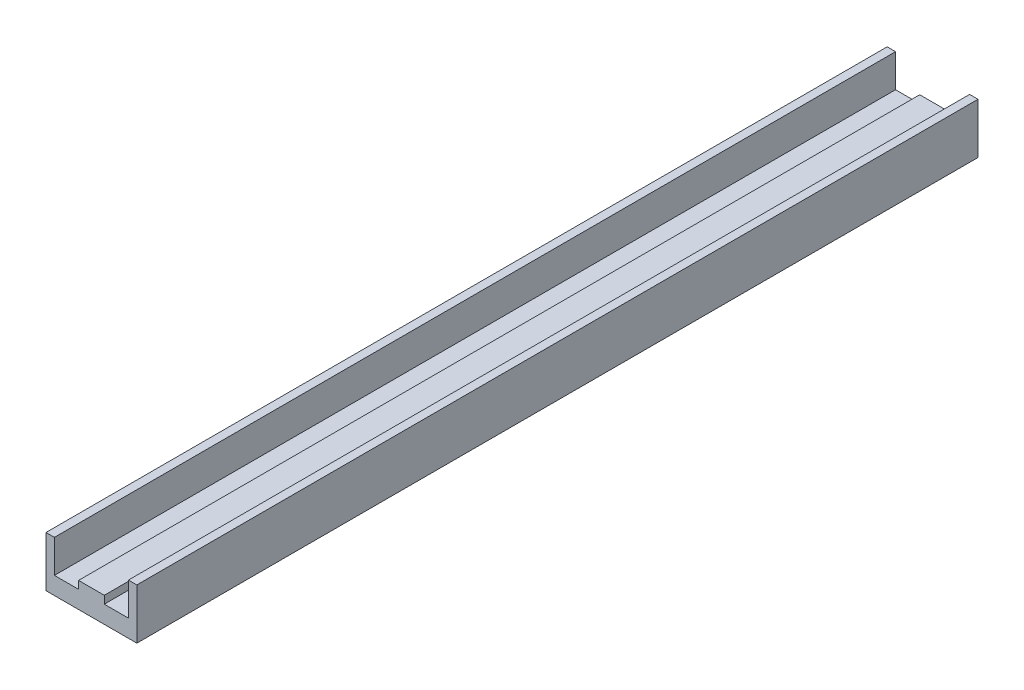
ISO-10303-21;
HEADER;
FILE_DESCRIPTION(('STEP AP214'),'2;1');
FILE_NAME('part.step','',(''),(''),'','','');
FILE_SCHEMA(('AUTOMOTIVE_DESIGN { 1 0 10303 214 1 1 1 1 }'));
ENDSEC;
DATA;
#1=APPLICATION_CONTEXT('core data for automotive mechanical design processes');
#2=APPLICATION_PROTOCOL_DEFINITION('international standard','automotive_design',2000,#1);
#3=PRODUCT_CONTEXT('',#1,'mechanical');
#4=PRODUCT('Part','Part','',(#3));
#5=PRODUCT_RELATED_PRODUCT_CATEGORY('part','',(#4));
#6=PRODUCT_DEFINITION_FORMATION('','',#4);
#7=PRODUCT_DEFINITION_CONTEXT('part definition',#1,'design');
#8=PRODUCT_DEFINITION('design','',#6,#7);
#9=PRODUCT_DEFINITION_SHAPE('','',#8);
#10=(LENGTH_UNIT() NAMED_UNIT(*) SI_UNIT(.MILLI.,.METRE.));
#11=(NAMED_UNIT(*) PLANE_ANGLE_UNIT() SI_UNIT($,.RADIAN.));
#12=(NAMED_UNIT(*) SI_UNIT($,.STERADIAN.) SOLID_ANGLE_UNIT());
#13=UNCERTAINTY_MEASURE_WITH_UNIT(LENGTH_MEASURE(1.E-05),#10,'distance_accuracy_value','');
#14=(GEOMETRIC_REPRESENTATION_CONTEXT(3) GLOBAL_UNCERTAINTY_ASSIGNED_CONTEXT((#13)) GLOBAL_UNIT_ASSIGNED_CONTEXT((#10,
#11,#12)) REPRESENTATION_CONTEXT('',''));
#15=CARTESIAN_POINT('',(0.,0.,0.));
#16=DIRECTION('',(0.,0.,1.));
#17=DIRECTION('',(1.,0.,0.));
#18=AXIS2_PLACEMENT_3D('',#15,#16,#17);
#19=CARTESIAN_POINT('',(-27.,30.,500.));
#20=DIRECTION('',(1.,0.,0.));
#21=DIRECTION('',(0.,0.,-1.));
#22=AXIS2_PLACEMENT_3D('',#19,#20,#21);
#23=PLANE('',#22);
#24=DIRECTION('',(0.,-1.,0.));
#25=VECTOR('',#24,1.);
#26=CARTESIAN_POINT('',(-27.,30.,0.));
#27=LINE('',#26,#25);
#28=CARTESIAN_POINT('',(-27.,30.,0.));
#29=VERTEX_POINT('',#28);
#30=CARTESIAN_POINT('',(-27.,0.,0.));
#31=VERTEX_POINT('',#30);
#32=EDGE_CURVE('E134',#29,#31,#27,.T.);
#33=ORIENTED_EDGE('',*,*,#32,.T.);
#34=DIRECTION('',(0.,0.,-1.));
#35=VECTOR('',#34,1.);
#36=CARTESIAN_POINT('',(-27.,0.,500.));
#37=LINE('',#36,#35);
#38=CARTESIAN_POINT('',(-27.,0.,500.));
#39=VERTEX_POINT('',#38);
#40=EDGE_CURVE('E9',#39,#31,#37,.T.);
#41=ORIENTED_EDGE('',*,*,#40,.F.);
#42=DIRECTION('',(0.,-1.,0.));
#43=VECTOR('',#42,1.);
#44=CARTESIAN_POINT('',(-27.,30.,500.));
#45=LINE('',#44,#43);
#46=CARTESIAN_POINT('',(-27.,30.,500.));
#47=VERTEX_POINT('',#46);
#48=EDGE_CURVE('E156',#47,#39,#45,.T.);
#49=ORIENTED_EDGE('',*,*,#48,.F.);
#50=DIRECTION('',(0.,0.,-1.));
#51=VECTOR('',#50,1.);
#52=CARTESIAN_POINT('',(-27.,30.,500.));
#53=LINE('',#52,#51);
#54=EDGE_CURVE('E130',#47,#29,#53,.T.);
#55=ORIENTED_EDGE('',*,*,#54,.T.);
#56=EDGE_LOOP('',(#33,#41,#49,#55));
#57=FACE_BOUND('',#56,.T.);
#58=ADVANCED_FACE('F14',(#57),#23,.F.);
#59=CARTESIAN_POINT('',(-27.,0.,500.));
#60=DIRECTION('',(0.,1.,0.));
#61=DIRECTION('',(0.,0.,1.));
#62=AXIS2_PLACEMENT_3D('',#59,#60,#61);
#63=PLANE('',#62);
#64=DIRECTION('',(1.,0.,0.));
#65=VECTOR('',#64,1.);
#66=CARTESIAN_POINT('',(-27.,0.,0.));
#67=LINE('',#66,#65);
#68=CARTESIAN_POINT('',(27.,0.,0.));
#69=VERTEX_POINT('',#68);
#70=EDGE_CURVE('E137',#31,#69,#67,.T.);
#71=ORIENTED_EDGE('',*,*,#70,.T.);
#72=DIRECTION('',(0.,0.,-1.));
#73=VECTOR('',#72,1.);
#74=CARTESIAN_POINT('',(27.,0.,500.));
#75=LINE('',#74,#73);
#76=CARTESIAN_POINT('',(27.,0.,500.));
#77=VERTEX_POINT('',#76);
#78=EDGE_CURVE('E22',#77,#69,#75,.T.);
#79=ORIENTED_EDGE('',*,*,#78,.F.);
#80=DIRECTION('',(1.,0.,0.));
#81=VECTOR('',#80,1.);
#82=CARTESIAN_POINT('',(-27.,0.,500.));
#83=LINE('',#82,#81);
#84=EDGE_CURVE('E85',#39,#77,#83,.T.);
#85=ORIENTED_EDGE('',*,*,#84,.F.);
#86=ORIENTED_EDGE('',*,*,#40,.T.);
#87=EDGE_LOOP('',(#71,#79,#85,#86));
#88=FACE_BOUND('',#87,.T.);
#89=ADVANCED_FACE('F236',(#88),#63,.F.);
#90=CARTESIAN_POINT('',(27.,30.,500.));
#91=DIRECTION('',(-1.,0.,0.));
#92=DIRECTION('',(0.,0.,1.));
#93=AXIS2_PLACEMENT_3D('',#90,#91,#92);
#94=PLANE('',#93);
#95=DIRECTION('',(0.,1.,0.));
#96=VECTOR('',#95,1.);
#97=CARTESIAN_POINT('',(27.,30.,0.));
#98=LINE('',#97,#96);
#99=CARTESIAN_POINT('',(27.,30.,0.));
#100=VERTEX_POINT('',#99);
#101=EDGE_CURVE('E139',#69,#100,#98,.T.);
#102=ORIENTED_EDGE('',*,*,#101,.T.);
#103=DIRECTION('',(0.,0.,-1.));
#104=VECTOR('',#103,1.);
#105=CARTESIAN_POINT('',(27.,30.,500.));
#106=LINE('',#105,#104);
#107=CARTESIAN_POINT('',(27.,30.,500.));
#108=VERTEX_POINT('',#107);
#109=EDGE_CURVE('E175',#108,#100,#106,.T.);
#110=ORIENTED_EDGE('',*,*,#109,.F.);
#111=DIRECTION('',(0.,1.,0.));
#112=VECTOR('',#111,1.);
#113=CARTESIAN_POINT('',(27.,30.,500.));
#114=LINE('',#113,#112);
#115=EDGE_CURVE('E183',#77,#108,#114,.T.);
#116=ORIENTED_EDGE('',*,*,#115,.F.);
#117=ORIENTED_EDGE('',*,*,#78,.T.);
#118=EDGE_LOOP('',(#102,#110,#116,#117));
#119=FACE_BOUND('',#118,.T.);
#120=ADVANCED_FACE('F181',(#119),#94,.F.);
#121=CARTESIAN_POINT('',(22.,30.,500.));
#122=DIRECTION('',(0.,-1.,0.));
#123=DIRECTION('',(0.,0.,-1.));
#124=AXIS2_PLACEMENT_3D('',#121,#122,#123);
#125=PLANE('',#124);
#126=DIRECTION('',(-1.,0.,0.));
#127=VECTOR('',#126,1.);
#128=CARTESIAN_POINT('',(22.,30.,0.));
#129=LINE('',#128,#127);
#130=CARTESIAN_POINT('',(22.,30.,0.));
#131=VERTEX_POINT('',#130);
#132=EDGE_CURVE('E141',#100,#131,#129,.T.);
#133=ORIENTED_EDGE('',*,*,#132,.T.);
#134=DIRECTION('',(0.,0.,-1.));
#135=VECTOR('',#134,1.);
#136=CARTESIAN_POINT('',(22.,30.,500.));
#137=LINE('',#136,#135);
#138=CARTESIAN_POINT('',(22.,30.,500.));
#139=VERTEX_POINT('',#138);
#140=EDGE_CURVE('E172',#139,#131,#137,.T.);
#141=ORIENTED_EDGE('',*,*,#140,.F.);
#142=DIRECTION('',(-1.,0.,0.));
#143=VECTOR('',#142,1.);
#144=CARTESIAN_POINT('',(22.,30.,500.));
#145=LINE('',#144,#143);
#146=EDGE_CURVE('E201',#108,#139,#145,.T.);
#147=ORIENTED_EDGE('',*,*,#146,.F.);
#148=ORIENTED_EDGE('',*,*,#109,.T.);
#149=EDGE_LOOP('',(#133,#141,#147,#148));
#150=FACE_BOUND('',#149,.T.);
#151=ADVANCED_FACE('F192',(#150),#125,.F.);
#152=CARTESIAN_POINT('',(22.,30.,500.));
#153=DIRECTION('',(1.,0.,0.));
#154=DIRECTION('',(0.,0.,-1.));
#155=AXIS2_PLACEMENT_3D('',#152,#153,#154);
#156=PLANE('',#155);
#157=DIRECTION('',(0.,-1.,0.));
#158=VECTOR('',#157,1.);
#159=CARTESIAN_POINT('',(22.,30.,0.));
#160=LINE('',#159,#158);
#161=CARTESIAN_POINT('',(22.,10.3999999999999,0.));
#162=VERTEX_POINT('',#161);
#163=EDGE_CURVE('E143',#131,#162,#160,.T.);
#164=ORIENTED_EDGE('',*,*,#163,.T.);
#165=DIRECTION('',(0.,0.,-1.));
#166=VECTOR('',#165,1.);
#167=CARTESIAN_POINT('',(22.,10.3999999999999,500.));
#168=LINE('',#167,#166);
#169=CARTESIAN_POINT('',(22.,10.3999999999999,500.));
#170=VERTEX_POINT('',#169);
#171=EDGE_CURVE('E169',#170,#162,#168,.T.);
#172=ORIENTED_EDGE('',*,*,#171,.F.);
#173=DIRECTION('',(0.,-1.,0.));
#174=VECTOR('',#173,1.);
#175=CARTESIAN_POINT('',(22.,30.,500.));
#176=LINE('',#175,#174);
#177=EDGE_CURVE('E198',#139,#170,#176,.T.);
#178=ORIENTED_EDGE('',*,*,#177,.F.);
#179=ORIENTED_EDGE('',*,*,#140,.T.);
#180=EDGE_LOOP('',(#164,#172,#178,#179));
#181=FACE_BOUND('',#180,.T.);
#182=ADVANCED_FACE('F196',(#181),#156,.F.);
#183=CARTESIAN_POINT('',(7.65,10.3999999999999,500.));
#184=DIRECTION('',(0.,-1.,0.));
#185=DIRECTION('',(0.,0.,-1.));
#186=AXIS2_PLACEMENT_3D('',#183,#184,#185);
#187=PLANE('',#186);
#188=DIRECTION('',(-1.,0.,0.));
#189=VECTOR('',#188,1.);
#190=CARTESIAN_POINT('',(7.65,10.3999999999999,0.));
#191=LINE('',#190,#189);
#192=CARTESIAN_POINT('',(7.65,10.3999999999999,0.));
#193=VERTEX_POINT('',#192);
#194=EDGE_CURVE('E145',#162,#193,#191,.T.);
#195=ORIENTED_EDGE('',*,*,#194,.T.);
#196=DIRECTION('',(0.,0.,-1.));
#197=VECTOR('',#196,1.);
#198=CARTESIAN_POINT('',(7.65,10.3999999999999,500.));
#199=LINE('',#198,#197);
#200=CARTESIAN_POINT('',(7.65,10.3999999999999,500.));
#201=VERTEX_POINT('',#200);
#202=EDGE_CURVE('E166',#201,#193,#199,.T.);
#203=ORIENTED_EDGE('',*,*,#202,.F.);
#204=DIRECTION('',(-1.,0.,0.));
#205=VECTOR('',#204,1.);
#206=CARTESIAN_POINT('',(7.65,10.3999999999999,500.));
#207=LINE('',#206,#205);
#208=EDGE_CURVE('E200',#170,#201,#207,.T.);
#209=ORIENTED_EDGE('',*,*,#208,.F.);
#210=ORIENTED_EDGE('',*,*,#171,.T.);
#211=EDGE_LOOP('',(#195,#203,#209,#210));
#212=FACE_BOUND('',#211,.T.);
#213=ADVANCED_FACE('F251',(#212),#187,.F.);
#214=CARTESIAN_POINT('',(7.65,15.,500.));
#215=DIRECTION('',(-1.,0.,0.));
#216=DIRECTION('',(0.,0.,1.));
#217=AXIS2_PLACEMENT_3D('',#214,#215,#216);
#218=PLANE('',#217);
#219=DIRECTION('',(0.,1.,0.));
#220=VECTOR('',#219,1.);
#221=CARTESIAN_POINT('',(7.65,15.,0.));
#222=LINE('',#221,#220);
#223=CARTESIAN_POINT('',(7.65,15.,0.));
#224=VERTEX_POINT('',#223);
#225=EDGE_CURVE('E147',#193,#224,#222,.T.);
#226=ORIENTED_EDGE('',*,*,#225,.T.);
#227=DIRECTION('',(0.,0.,-1.));
#228=VECTOR('',#227,1.);
#229=CARTESIAN_POINT('',(7.65,15.,500.));
#230=LINE('',#229,#228);
#231=CARTESIAN_POINT('',(7.65,15.,500.));
#232=VERTEX_POINT('',#231);
#233=EDGE_CURVE('E163',#232,#224,#230,.T.);
#234=ORIENTED_EDGE('',*,*,#233,.F.);
#235=DIRECTION('',(0.,1.,0.));
#236=VECTOR('',#235,1.);
#237=CARTESIAN_POINT('',(7.65,15.,500.));
#238=LINE('',#237,#236);
#239=EDGE_CURVE('E203',#201,#232,#238,.T.);
#240=ORIENTED_EDGE('',*,*,#239,.F.);
#241=ORIENTED_EDGE('',*,*,#202,.T.);
#242=EDGE_LOOP('',(#226,#234,#240,#241));
#243=FACE_BOUND('',#242,.T.);
#244=ADVANCED_FACE('F254',(#243),#218,.F.);
#245=CARTESIAN_POINT('',(-7.65,15.,500.));
#246=DIRECTION('',(0.,-1.,0.));
#247=DIRECTION('',(0.,0.,-1.));
#248=AXIS2_PLACEMENT_3D('',#245,#246,#247);
#249=PLANE('',#248);
#250=DIRECTION('',(-1.,0.,0.));
#251=VECTOR('',#250,1.);
#252=CARTESIAN_POINT('',(-7.65,15.,0.));
#253=LINE('',#252,#251);
#254=CARTESIAN_POINT('',(-7.65,15.,0.));
#255=VERTEX_POINT('',#254);
#256=EDGE_CURVE('E149',#224,#255,#253,.T.);
#257=ORIENTED_EDGE('',*,*,#256,.T.);
#258=DIRECTION('',(0.,0.,-1.));
#259=VECTOR('',#258,1.);
#260=CARTESIAN_POINT('',(-7.65,15.,500.));
#261=LINE('',#260,#259);
#262=CARTESIAN_POINT('',(-7.65,15.,500.));
#263=VERTEX_POINT('',#262);
#264=EDGE_CURVE('E160',#263,#255,#261,.T.);
#265=ORIENTED_EDGE('',*,*,#264,.F.);
#266=DIRECTION('',(-1.,0.,0.));
#267=VECTOR('',#266,1.);
#268=CARTESIAN_POINT('',(-7.65,15.,500.));
#269=LINE('',#268,#267);
#270=EDGE_CURVE('E209',#232,#263,#269,.T.);
#271=ORIENTED_EDGE('',*,*,#270,.F.);
#272=ORIENTED_EDGE('',*,*,#233,.T.);
#273=EDGE_LOOP('',(#257,#265,#271,#272));
#274=FACE_BOUND('',#273,.T.);
#275=ADVANCED_FACE('F215',(#274),#249,.F.);
#276=CARTESIAN_POINT('',(-7.65,15.,500.));
#277=DIRECTION('',(1.,0.,0.));
#278=DIRECTION('',(0.,0.,-1.));
#279=AXIS2_PLACEMENT_3D('',#276,#277,#278);
#280=PLANE('',#279);
#281=DIRECTION('',(0.,-1.,0.));
#282=VECTOR('',#281,1.);
#283=CARTESIAN_POINT('',(-7.65,15.,0.));
#284=LINE('',#283,#282);
#285=CARTESIAN_POINT('',(-7.65,10.3999999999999,0.));
#286=VERTEX_POINT('',#285);
#287=EDGE_CURVE('E151',#255,#286,#284,.T.);
#288=ORIENTED_EDGE('',*,*,#287,.T.);
#289=DIRECTION('',(0.,0.,-1.));
#290=VECTOR('',#289,1.);
#291=CARTESIAN_POINT('',(-7.65,10.3999999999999,500.));
#292=LINE('',#291,#290);
#293=CARTESIAN_POINT('',(-7.65,10.3999999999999,500.));
#294=VERTEX_POINT('',#293);
#295=EDGE_CURVE('E125',#294,#286,#292,.T.);
#296=ORIENTED_EDGE('',*,*,#295,.F.);
#297=DIRECTION('',(0.,-1.,0.));
#298=VECTOR('',#297,1.);
#299=CARTESIAN_POINT('',(-7.65,15.,500.));
#300=LINE('',#299,#298);
#301=EDGE_CURVE('E116',#263,#294,#300,.T.);
#302=ORIENTED_EDGE('',*,*,#301,.F.);
#303=ORIENTED_EDGE('',*,*,#264,.T.);
#304=EDGE_LOOP('',(#288,#296,#302,#303));
#305=FACE_BOUND('',#304,.T.);
#306=ADVANCED_FACE('F219',(#305),#280,.F.);
#307=CARTESIAN_POINT('',(-22.,10.3999999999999,500.));
#308=DIRECTION('',(0.,-1.,0.));
#309=DIRECTION('',(0.,0.,-1.));
#310=AXIS2_PLACEMENT_3D('',#307,#308,#309);
#311=PLANE('',#310);
#312=DIRECTION('',(-1.,0.,0.));
#313=VECTOR('',#312,1.);
#314=CARTESIAN_POINT('',(-22.,10.3999999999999,0.));
#315=LINE('',#314,#313);
#316=CARTESIAN_POINT('',(-22.,10.3999999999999,0.));
#317=VERTEX_POINT('',#316);
#318=EDGE_CURVE('E124',#286,#317,#315,.T.);
#319=ORIENTED_EDGE('',*,*,#318,.T.);
#320=DIRECTION('',(0.,0.,-1.));
#321=VECTOR('',#320,1.);
#322=CARTESIAN_POINT('',(-22.,10.3999999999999,500.));
#323=LINE('',#322,#321);
#324=CARTESIAN_POINT('',(-22.,10.3999999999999,500.));
#325=VERTEX_POINT('',#324);
#326=EDGE_CURVE('E121',#325,#317,#323,.T.);
#327=ORIENTED_EDGE('',*,*,#326,.F.);
#328=DIRECTION('',(-1.,0.,0.));
#329=VECTOR('',#328,1.);
#330=CARTESIAN_POINT('',(-22.,10.3999999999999,500.));
#331=LINE('',#330,#329);
#332=EDGE_CURVE('E110',#294,#325,#331,.T.);
#333=ORIENTED_EDGE('',*,*,#332,.F.);
#334=ORIENTED_EDGE('',*,*,#295,.T.);
#335=EDGE_LOOP('',(#319,#327,#333,#334));
#336=FACE_BOUND('',#335,.T.);
#337=ADVANCED_FACE('F122',(#336),#311,.F.);
#338=CARTESIAN_POINT('',(-22.,30.,500.));
#339=DIRECTION('',(-1.,0.,0.));
#340=DIRECTION('',(0.,0.,1.));
#341=AXIS2_PLACEMENT_3D('',#338,#339,#340);
#342=PLANE('',#341);
#343=DIRECTION('',(0.,1.,0.));
#344=VECTOR('',#343,1.);
#345=CARTESIAN_POINT('',(-22.,30.,0.));
#346=LINE('',#345,#344);
#347=CARTESIAN_POINT('',(-22.,30.,0.));
#348=VERTEX_POINT('',#347);
#349=EDGE_CURVE('E71',#317,#348,#346,.T.);
#350=ORIENTED_EDGE('',*,*,#349,.T.);
#351=DIRECTION('',(0.,0.,-1.));
#352=VECTOR('',#351,1.);
#353=CARTESIAN_POINT('',(-22.,30.,500.));
#354=LINE('',#353,#352);
#355=CARTESIAN_POINT('',(-22.,30.,500.));
#356=VERTEX_POINT('',#355);
#357=EDGE_CURVE('E126',#356,#348,#354,.T.);
#358=ORIENTED_EDGE('',*,*,#357,.F.);
#359=DIRECTION('',(0.,1.,0.));
#360=VECTOR('',#359,1.);
#361=CARTESIAN_POINT('',(-22.,30.,500.));
#362=LINE('',#361,#360);
#363=EDGE_CURVE('E114',#325,#356,#362,.T.);
#364=ORIENTED_EDGE('',*,*,#363,.F.);
#365=ORIENTED_EDGE('',*,*,#326,.T.);
#366=EDGE_LOOP('',(#350,#358,#364,#365));
#367=FACE_BOUND('',#366,.T.);
#368=ADVANCED_FACE('F128',(#367),#342,.F.);
#369=CARTESIAN_POINT('',(-27.,30.,500.));
#370=DIRECTION('',(0.,-1.,0.));
#371=DIRECTION('',(0.,0.,-1.));
#372=AXIS2_PLACEMENT_3D('',#369,#370,#371);
#373=PLANE('',#372);
#374=DIRECTION('',(-1.,0.,0.));
#375=VECTOR('',#374,1.);
#376=CARTESIAN_POINT('',(-27.,30.,0.));
#377=LINE('',#376,#375);
#378=EDGE_CURVE('E77',#348,#29,#377,.T.);
#379=ORIENTED_EDGE('',*,*,#378,.T.);
#380=ORIENTED_EDGE('',*,*,#54,.F.);
#381=DIRECTION('',(-1.,0.,0.));
#382=VECTOR('',#381,1.);
#383=CARTESIAN_POINT('',(-27.,30.,500.));
#384=LINE('',#383,#382);
#385=EDGE_CURVE('E30',#356,#47,#384,.T.);
#386=ORIENTED_EDGE('',*,*,#385,.F.);
#387=ORIENTED_EDGE('',*,*,#357,.T.);
#388=EDGE_LOOP('',(#379,#380,#386,#387));
#389=FACE_BOUND('',#388,.T.);
#390=ADVANCED_FACE('F223',(#389),#373,.F.);
#391=CARTESIAN_POINT('',(-27.,0.,500.));
#392=DIRECTION('',(0.,0.,1.));
#393=DIRECTION('',(1.,0.,0.));
#394=AXIS2_PLACEMENT_3D('',#391,#392,#393);
#395=PLANE('',#394);
#396=ORIENTED_EDGE('',*,*,#48,.T.);
#397=ORIENTED_EDGE('',*,*,#84,.T.);
#398=ORIENTED_EDGE('',*,*,#115,.T.);
#399=ORIENTED_EDGE('',*,*,#146,.T.);
#400=ORIENTED_EDGE('',*,*,#177,.T.);
#401=ORIENTED_EDGE('',*,*,#208,.T.);
#402=ORIENTED_EDGE('',*,*,#239,.T.);
#403=ORIENTED_EDGE('',*,*,#270,.T.);
#404=ORIENTED_EDGE('',*,*,#301,.T.);
#405=ORIENTED_EDGE('',*,*,#332,.T.);
#406=ORIENTED_EDGE('',*,*,#363,.T.);
#407=ORIENTED_EDGE('',*,*,#385,.T.);
#408=EDGE_LOOP('',(#396,#397,#398,#399,#400,#401,#402,#403,#404,#405,#406,#407));
#409=FACE_BOUND('',#408,.T.);
#410=ADVANCED_FACE('F112',(#409),#395,.T.);
#411=CARTESIAN_POINT('',(-27.,0.,0.));
#412=DIRECTION('',(0.,0.,1.));
#413=DIRECTION('',(1.,0.,0.));
#414=AXIS2_PLACEMENT_3D('',#411,#412,#413);
#415=PLANE('',#414);
#416=ORIENTED_EDGE('',*,*,#32,.F.);
#417=ORIENTED_EDGE('',*,*,#378,.F.);
#418=ORIENTED_EDGE('',*,*,#349,.F.);
#419=ORIENTED_EDGE('',*,*,#318,.F.);
#420=ORIENTED_EDGE('',*,*,#287,.F.);
#421=ORIENTED_EDGE('',*,*,#256,.F.);
#422=ORIENTED_EDGE('',*,*,#225,.F.);
#423=ORIENTED_EDGE('',*,*,#194,.F.);
#424=ORIENTED_EDGE('',*,*,#163,.F.);
#425=ORIENTED_EDGE('',*,*,#132,.F.);
#426=ORIENTED_EDGE('',*,*,#101,.F.);
#427=ORIENTED_EDGE('',*,*,#70,.F.);
#428=EDGE_LOOP('',(#416,#417,#418,#419,#420,#421,#422,#423,#424,#425,#426,#427));
#429=FACE_BOUND('',#428,.T.);
#430=ADVANCED_FACE('F187',(#429),#415,.F.);
#431=CLOSED_SHELL('',(#58,#89,#120,#151,#182,#213,#244,#275,#306,#337,#368,#390,#410,#430));
#432=MANIFOLD_SOLID_BREP('B1',#431);
#433=ADVANCED_BREP_SHAPE_REPRESENTATION('',(#18,#432),#14);
#434=SHAPE_DEFINITION_REPRESENTATION(#9,#433);
ENDSEC;
END-ISO-10303-21;
